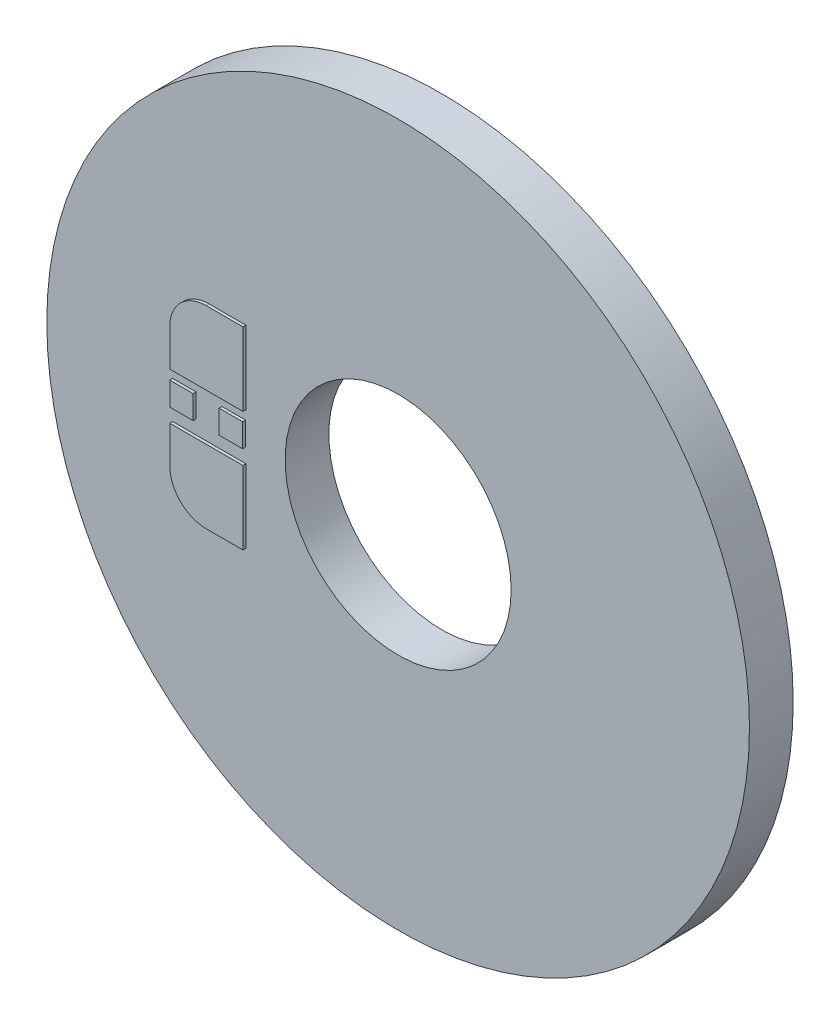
from build123d import *

# Parameters (mm, degrees)
SKETCH1_R               = 15.24
SKETCH1_R_2             = 4.7625
EXTRUDE1_DEPTH          = 1.89738
EXTRUDE3_DEPTH          = 0.127
EXTRUDE4_DEPTH          = 1.89738
CIRPATTERN1_COUNT       = 3
CUT_EXTRUDE1_DEPTH      = 10
CUT_EXTRUDE1_DEPTH_BACK = 2.54
SKETCH9_OUTSIDE_W       = 47.003
SKETCH9_OUTSIDE_H       = 46.972
SKETCH9_OUTSIDE_R       = 15.24
SKETCH9_OUTSIDE_R_2     = 4.9022
SKETCH12_W              = 1.016
SKETCH12_H              = 1.016
EXTRUDE6_DEPTH          = 0.127


with BuildPart() as part:
    # Sketch1 → Extrude1 (new body)
    with BuildSketch(Plane.XY):
        with Locations(Location((0, 0, 0), (0, 0, 180))):
            Circle(SKETCH1_R)
        with Locations(Location((0, 0, 0), (0, 0, 180))):
            Circle(SKETCH1_R_2, mode=Mode.SUBTRACT)
    extrude(amount=EXTRUDE1_DEPTH)

    # Sketch3 → Extrude3 (add)
    with BuildSketch(Plane.XY.offset(1.89738)):
        with BuildLine():
            Line((-8.2042, 4.191), (-6.604, 4.191))
            Line((-6.604, 4.191), (-6.604, 1.016))
            Line((-6.604, 1.016), (-9.779, 1.016))
            Line((-9.779, 1.016), (-9.779, 2.6162))
            ThreePointArc((-9.779, 2.6162), (-9.317751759, 3.729751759), (-8.2042, 4.191))
        make_face()
    extrude3 = extrude(amount=EXTRUDE3_DEPTH)

    # Mirror1: Extrude3 across plane
    add(extrude3.mirror(Plane.ZX))

    # Sketch4 → Extrude4 (add)
    with BuildSketch(Plane.XY):
        with BuildLine():
            Line((15.022527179, -2.5654), (17.272, -2.5654))
            ThreePointArc((17.272, -2.5654), (19.8374, 0), (17.272, 2.5654))
            Line((17.272, 2.5654), (15.022527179, 2.5654))
            Line((15.022527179, 2.5654), (15.022527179, -2.5654))
        make_face()
    extrude4 = extrude(amount=EXTRUDE4_DEPTH)

    # CirPattern1: Extrude4 ×3 about axis
    cirpattern1_axis = Axis((0, 0, 0), (0, 0, 1))
    for i in range(1, CIRPATTERN1_COUNT):
        add(extrude4.rotate(cirpattern1_axis, i * 360 / CIRPATTERN1_COUNT))

    # Sketch9 outside → Cut-Extrude1 (cut, two sides: drawn at the far end of the back side and taken through both)
    # profile 1 of 2: a face of its own
    with BuildSketch(Plane.XY.offset(1.89738).offset(-CUT_EXTRUDE1_DEPTH_BACK)):
        with Locations((2.2985, 0)):
            Rectangle(SKETCH9_OUTSIDE_W, SKETCH9_OUTSIDE_H)
        with Locations(Location((0, 0, 0), (0, 0, 180))):
            Circle(SKETCH9_OUTSIDE_R, mode=Mode.SUBTRACT)
    # profile 2 of 2: a face of its own
    with BuildSketch(Plane.XY.offset(1.89738).offset(-CUT_EXTRUDE1_DEPTH_BACK)):
        Circle(SKETCH9_OUTSIDE_R_2)
    extrude(amount=CUT_EXTRUDE1_DEPTH + CUT_EXTRUDE1_DEPTH_BACK, mode=Mode.SUBTRACT)

    # Sketch12 → Extrude6 (add)
    with BuildSketch(Plane.XY.offset(1.89738)):
        with Locations((-9.271, 0.09538319)):
            Rectangle(SKETCH12_W, SKETCH12_H)
        with Locations((-7.128999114, 0.110546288)):
            Rectangle(SKETCH12_W, SKETCH12_H)
    extrude(amount=EXTRUDE6_DEPTH)


solid = part.part
